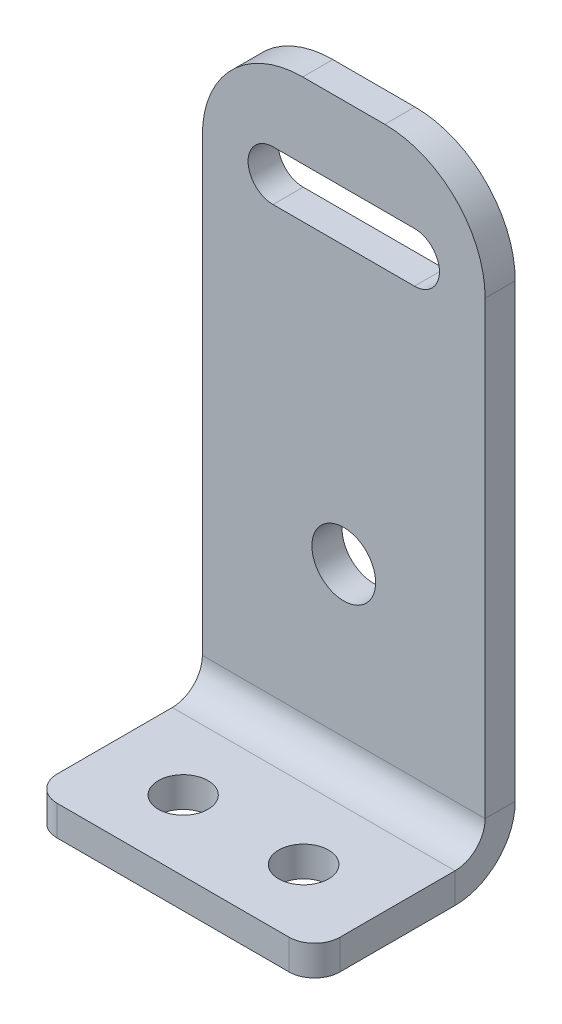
ISO-10303-21;
HEADER;
FILE_DESCRIPTION(('STEP AP214'),'2;1');
FILE_NAME('part.step','',(''),(''),'','','');
FILE_SCHEMA(('AUTOMOTIVE_DESIGN { 1 0 10303 214 1 1 1 1 }'));
ENDSEC;
DATA;
#1=APPLICATION_CONTEXT('core data for automotive mechanical design processes');
#2=APPLICATION_PROTOCOL_DEFINITION('international standard','automotive_design',2000,#1);
#3=PRODUCT_CONTEXT('',#1,'mechanical');
#4=PRODUCT('Part','Part','',(#3));
#5=PRODUCT_RELATED_PRODUCT_CATEGORY('part','',(#4));
#6=PRODUCT_DEFINITION_FORMATION('','',#4);
#7=PRODUCT_DEFINITION_CONTEXT('part definition',#1,'design');
#8=PRODUCT_DEFINITION('design','',#6,#7);
#9=PRODUCT_DEFINITION_SHAPE('','',#8);
#10=(LENGTH_UNIT() NAMED_UNIT(*) SI_UNIT(.MILLI.,.METRE.));
#11=(NAMED_UNIT(*) PLANE_ANGLE_UNIT() SI_UNIT($,.RADIAN.));
#12=(NAMED_UNIT(*) SI_UNIT($,.STERADIAN.) SOLID_ANGLE_UNIT());
#13=UNCERTAINTY_MEASURE_WITH_UNIT(LENGTH_MEASURE(1.E-05),#10,'distance_accuracy_value','');
#14=(GEOMETRIC_REPRESENTATION_CONTEXT(3) GLOBAL_UNCERTAINTY_ASSIGNED_CONTEXT((#13)) GLOBAL_UNIT_ASSIGNED_CONTEXT((#10,
#11,#12)) REPRESENTATION_CONTEXT('',''));
#15=CARTESIAN_POINT('',(0.,0.,0.));
#16=DIRECTION('',(0.,0.,1.));
#17=DIRECTION('',(1.,0.,0.));
#18=AXIS2_PLACEMENT_3D('',#15,#16,#17);
#19=CARTESIAN_POINT('',(28.175,0.,3.));
#20=DIRECTION('',(1.,0.,0.));
#21=DIRECTION('',(0.,1.,0.));
#22=AXIS2_PLACEMENT_3D('',#19,#20,#21);
#23=PLANE('',#22);
#24=DIRECTION('',(0.,1.,0.));
#25=VECTOR('',#24,1.);
#26=CARTESIAN_POINT('',(28.175,0.,-9.60000000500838E-08));
#27=LINE('',#26,#25);
#28=CARTESIAN_POINT('',(28.175,6.00000009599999,-9.59999996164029E-08));
#29=VERTEX_POINT('',#28);
#30=CARTESIAN_POINT('',(28.175,50.9125,-9.60000000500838E-08));
#31=VERTEX_POINT('',#30);
#32=EDGE_CURVE('E307',#29,#31,#27,.T.);
#33=ORIENTED_EDGE('',*,*,#32,.T.);
#34=DIRECTION('',(0.,0.,-1.));
#35=VECTOR('',#34,1.);
#36=CARTESIAN_POINT('',(28.175,50.9125,3.));
#37=LINE('',#36,#35);
#38=CARTESIAN_POINT('',(28.175,50.9125,3.));
#39=VERTEX_POINT('',#38);
#40=EDGE_CURVE('E13',#31,#39,#37,.F.);
#41=ORIENTED_EDGE('',*,*,#40,.T.);
#42=DIRECTION('',(0.,1.,0.));
#43=VECTOR('',#42,1.);
#44=CARTESIAN_POINT('',(28.175,0.,3.));
#45=LINE('',#44,#43);
#46=CARTESIAN_POINT('',(28.175,6.00000009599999,3.));
#47=VERTEX_POINT('',#46);
#48=EDGE_CURVE('E275',#47,#39,#45,.T.);
#49=ORIENTED_EDGE('',*,*,#48,.F.);
#50=DIRECTION('',(0.,0.,-1.));
#51=VECTOR('',#50,1.);
#52=CARTESIAN_POINT('',(28.175,6.00000009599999,3.));
#53=LINE('',#52,#51);
#54=EDGE_CURVE('E253',#47,#29,#53,.T.);
#55=ORIENTED_EDGE('',*,*,#54,.T.);
#56=EDGE_LOOP('',(#33,#41,#49,#55));
#57=FACE_BOUND('',#56,.T.);
#58=ADVANCED_FACE('F66',(#57),#23,.T.);
#59=CARTESIAN_POINT('',(0.,0.,3.));
#60=DIRECTION('',(0.,0.,1.));
#61=DIRECTION('',(1.,0.,0.));
#62=AXIS2_PLACEMENT_3D('',#59,#60,#61);
#63=PLANE('',#62);
#64=CARTESIAN_POINT('',(14.0875,20.9125,3.));
#65=DIRECTION('',(0.,0.,1.));
#66=DIRECTION('',(1.,0.,0.));
#67=AXIS2_PLACEMENT_3D('',#64,#65,#66);
#68=CIRCLE('',#67,3.175);
#69=CARTESIAN_POINT('',(17.2625,20.9125,3.));
#70=VERTEX_POINT('',#69);
#71=EDGE_CURVE('E271',#70,#70,#68,.T.);
#72=ORIENTED_EDGE('',*,*,#71,.F.);
#73=EDGE_LOOP('',(#72));
#74=FACE_BOUND('',#73,.T.);
#75=CARTESIAN_POINT('',(21.13125,50.9125,3.));
#76=DIRECTION('',(0.,0.,1.));
#77=DIRECTION('',(1.,0.,0.));
#78=AXIS2_PLACEMENT_3D('',#75,#76,#77);
#79=CIRCLE('',#78,2.4892);
#80=CARTESIAN_POINT('',(21.13125,48.4233,3.));
#81=VERTEX_POINT('',#80);
#82=CARTESIAN_POINT('',(21.13125,53.4017,3.));
#83=VERTEX_POINT('',#82);
#84=EDGE_CURVE('E287',#81,#83,#79,.T.);
#85=ORIENTED_EDGE('',*,*,#84,.F.);
#86=DIRECTION('',(1.,0.,0.));
#87=VECTOR('',#86,1.);
#88=CARTESIAN_POINT('',(0.,48.4233,3.));
#89=LINE('',#88,#87);
#90=CARTESIAN_POINT('',(7.04375,48.4233,3.));
#91=VERTEX_POINT('',#90);
#92=EDGE_CURVE('E291',#91,#81,#89,.T.);
#93=ORIENTED_EDGE('',*,*,#92,.F.);
#94=CARTESIAN_POINT('',(7.04375,50.9125,3.));
#95=DIRECTION('',(0.,0.,1.));
#96=DIRECTION('',(1.,0.,0.));
#97=AXIS2_PLACEMENT_3D('',#94,#95,#96);
#98=CIRCLE('',#97,2.4892);
#99=CARTESIAN_POINT('',(7.04375,53.4017,3.));
#100=VERTEX_POINT('',#99);
#101=EDGE_CURVE('E295',#100,#91,#98,.T.);
#102=ORIENTED_EDGE('',*,*,#101,.F.);
#103=DIRECTION('',(1.,0.,0.));
#104=VECTOR('',#103,1.);
#105=CARTESIAN_POINT('',(0.,53.4017,3.));
#106=LINE('',#105,#104);
#107=EDGE_CURVE('E299',#100,#83,#106,.T.);
#108=ORIENTED_EDGE('',*,*,#107,.T.);
#109=EDGE_LOOP('',(#85,#93,#102,#108));
#110=FACE_BOUND('',#109,.T.);
#111=DIRECTION('',(1.,0.,0.));
#112=VECTOR('',#111,1.);
#113=CARTESIAN_POINT('',(0.,60.9125,3.));
#114=LINE('',#113,#112);
#115=CARTESIAN_POINT('',(10.,60.9125,3.));
#116=VERTEX_POINT('',#115);
#117=CARTESIAN_POINT('',(18.175,60.9125,3.));
#118=VERTEX_POINT('',#117);
#119=EDGE_CURVE('E280',#116,#118,#114,.T.);
#120=ORIENTED_EDGE('',*,*,#119,.F.);
#121=CARTESIAN_POINT('',(10.,50.9125,3.));
#122=DIRECTION('',(0.,0.,1.));
#123=DIRECTION('',(1.,0.,0.));
#124=AXIS2_PLACEMENT_3D('',#121,#122,#123);
#125=CIRCLE('',#124,10.);
#126=CARTESIAN_POINT('',(0.,50.9125,3.));
#127=VERTEX_POINT('',#126);
#128=EDGE_CURVE('E377',#116,#127,#125,.T.);
#129=ORIENTED_EDGE('',*,*,#128,.T.);
#130=DIRECTION('',(0.,1.,0.));
#131=VECTOR('',#130,1.);
#132=CARTESIAN_POINT('',(0.,0.,3.));
#133=LINE('',#132,#131);
#134=CARTESIAN_POINT('',(0.,6.00000009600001,3.));
#135=VERTEX_POINT('',#134);
#136=EDGE_CURVE('E284',#135,#127,#133,.T.);
#137=ORIENTED_EDGE('',*,*,#136,.F.);
#138=DIRECTION('',(1.,0.,0.));
#139=VECTOR('',#138,1.);
#140=CARTESIAN_POINT('',(28.175,6.00000009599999,3.));
#141=LINE('',#140,#139);
#142=EDGE_CURVE('E258',#47,#135,#141,.F.);
#143=ORIENTED_EDGE('',*,*,#142,.F.);
#144=ORIENTED_EDGE('',*,*,#48,.T.);
#145=CARTESIAN_POINT('',(18.175,50.9125,3.));
#146=DIRECTION('',(0.,0.,1.));
#147=DIRECTION('',(1.,0.,0.));
#148=AXIS2_PLACEMENT_3D('',#145,#146,#147);
#149=CIRCLE('',#148,10.);
#150=EDGE_CURVE('E374',#39,#118,#149,.T.);
#151=ORIENTED_EDGE('',*,*,#150,.T.);
#152=EDGE_LOOP('',(#120,#129,#137,#143,#144,#151));
#153=FACE_BOUND('',#152,.T.);
#154=ADVANCED_FACE('F397',(#74,#110,#153),#63,.T.);
#155=CARTESIAN_POINT('',(0.,0.,-9.60000000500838E-08));
#156=DIRECTION('',(0.,0.,1.));
#157=DIRECTION('',(1.,0.,0.));
#158=AXIS2_PLACEMENT_3D('',#155,#156,#157);
#159=PLANE('',#158);
#160=CARTESIAN_POINT('',(21.13125,50.9125,-9.60000000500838E-08));
#161=DIRECTION('',(0.,0.,1.));
#162=DIRECTION('',(1.,0.,0.));
#163=AXIS2_PLACEMENT_3D('',#160,#161,#162);
#164=CIRCLE('',#163,2.4892);
#165=CARTESIAN_POINT('',(21.13125,48.4233,-9.60000000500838E-08));
#166=VERTEX_POINT('',#165);
#167=CARTESIAN_POINT('',(21.13125,53.4017,-9.60000000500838E-08));
#168=VERTEX_POINT('',#167);
#169=EDGE_CURVE('E314',#166,#168,#164,.T.);
#170=ORIENTED_EDGE('',*,*,#169,.T.);
#171=DIRECTION('',(1.,0.,0.));
#172=VECTOR('',#171,1.);
#173=CARTESIAN_POINT('',(0.,53.4017,-9.60000000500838E-08));
#174=LINE('',#173,#172);
#175=CARTESIAN_POINT('',(7.04375,53.4017,-9.60000000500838E-08));
#176=VERTEX_POINT('',#175);
#177=EDGE_CURVE('E276',#176,#168,#174,.T.);
#178=ORIENTED_EDGE('',*,*,#177,.F.);
#179=CARTESIAN_POINT('',(7.04375,50.9125,-9.60000000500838E-08));
#180=DIRECTION('',(0.,0.,1.));
#181=DIRECTION('',(1.,0.,0.));
#182=AXIS2_PLACEMENT_3D('',#179,#180,#181);
#183=CIRCLE('',#182,2.4892);
#184=CARTESIAN_POINT('',(7.04375,48.4233,-9.60000000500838E-08));
#185=VERTEX_POINT('',#184);
#186=EDGE_CURVE('E324',#176,#185,#183,.T.);
#187=ORIENTED_EDGE('',*,*,#186,.T.);
#188=DIRECTION('',(1.,0.,0.));
#189=VECTOR('',#188,1.);
#190=CARTESIAN_POINT('',(0.,48.4233,-9.60000000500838E-08));
#191=LINE('',#190,#189);
#192=EDGE_CURVE('E320',#185,#166,#191,.T.);
#193=ORIENTED_EDGE('',*,*,#192,.T.);
#194=EDGE_LOOP('',(#170,#178,#187,#193));
#195=FACE_BOUND('',#194,.T.);
#196=CARTESIAN_POINT('',(14.0875,20.9125,-9.60000000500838E-08));
#197=DIRECTION('',(0.,0.,1.));
#198=DIRECTION('',(1.,0.,0.));
#199=AXIS2_PLACEMENT_3D('',#196,#197,#198);
#200=CIRCLE('',#199,3.175);
#201=CARTESIAN_POINT('',(17.2625,20.9125,-9.60000000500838E-08));
#202=VERTEX_POINT('',#201);
#203=EDGE_CURVE('E268',#202,#202,#200,.T.);
#204=ORIENTED_EDGE('',*,*,#203,.T.);
#205=EDGE_LOOP('',(#204));
#206=FACE_BOUND('',#205,.T.);
#207=DIRECTION('',(0.,1.,0.));
#208=VECTOR('',#207,1.);
#209=CARTESIAN_POINT('',(0.,0.,-9.60000000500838E-08));
#210=LINE('',#209,#208);
#211=CARTESIAN_POINT('',(0.,6.00000009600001,-9.60000000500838E-08));
#212=VERTEX_POINT('',#211);
#213=CARTESIAN_POINT('',(0.,50.9125,-9.60000000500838E-08));
#214=VERTEX_POINT('',#213);
#215=EDGE_CURVE('E311',#212,#214,#210,.T.);
#216=ORIENTED_EDGE('',*,*,#215,.T.);
#217=CARTESIAN_POINT('',(10.,50.9125,-9.60000000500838E-08));
#218=DIRECTION('',(0.,0.,1.));
#219=DIRECTION('',(1.,0.,0.));
#220=AXIS2_PLACEMENT_3D('',#217,#218,#219);
#221=CIRCLE('',#220,10.);
#222=CARTESIAN_POINT('',(10.,60.9125,-9.60000000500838E-08));
#223=VERTEX_POINT('',#222);
#224=EDGE_CURVE('E75',#214,#223,#221,.F.);
#225=ORIENTED_EDGE('',*,*,#224,.T.);
#226=DIRECTION('',(1.,0.,0.));
#227=VECTOR('',#226,1.);
#228=CARTESIAN_POINT('',(0.,60.9125,-9.60000000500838E-08));
#229=LINE('',#228,#227);
#230=CARTESIAN_POINT('',(18.175,60.9125,-9.60000000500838E-08));
#231=VERTEX_POINT('',#230);
#232=EDGE_CURVE('E310',#223,#231,#229,.T.);
#233=ORIENTED_EDGE('',*,*,#232,.T.);
#234=CARTESIAN_POINT('',(18.175,50.9125,-9.60000000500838E-08));
#235=DIRECTION('',(0.,0.,1.));
#236=DIRECTION('',(1.,0.,0.));
#237=AXIS2_PLACEMENT_3D('',#234,#235,#236);
#238=CIRCLE('',#237,10.);
#239=EDGE_CURVE('E82',#231,#31,#238,.F.);
#240=ORIENTED_EDGE('',*,*,#239,.T.);
#241=ORIENTED_EDGE('',*,*,#32,.F.);
#242=DIRECTION('',(1.,0.,0.));
#243=VECTOR('',#242,1.);
#244=CARTESIAN_POINT('',(28.175,6.00000009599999,-9.59999996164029E-08));
#245=LINE('',#244,#243);
#246=EDGE_CURVE('E192',#29,#212,#245,.F.);
#247=ORIENTED_EDGE('',*,*,#246,.T.);
#248=EDGE_LOOP('',(#216,#225,#233,#240,#241,#247));
#249=FACE_BOUND('',#248,.T.);
#250=ADVANCED_FACE('F387',(#195,#206,#249),#159,.F.);
#251=CARTESIAN_POINT('',(7.04375,50.9125,3.));
#252=DIRECTION('',(0.,0.,1.));
#253=DIRECTION('',(1.,0.,0.));
#254=AXIS2_PLACEMENT_3D('',#251,#252,#253);
#255=CYLINDRICAL_SURFACE('',#254,2.4892);
#256=DIRECTION('',(0.,0.,1.));
#257=VECTOR('',#256,1.);
#258=CARTESIAN_POINT('',(7.04375,48.4233,3.));
#259=LINE('',#258,#257);
#260=EDGE_CURVE('E337',#185,#91,#259,.T.);
#261=ORIENTED_EDGE('',*,*,#260,.F.);
#262=ORIENTED_EDGE('',*,*,#186,.F.);
#263=DIRECTION('',(0.,0.,1.));
#264=VECTOR('',#263,1.);
#265=CARTESIAN_POINT('',(7.04375,53.4017,3.));
#266=LINE('',#265,#264);
#267=EDGE_CURVE('E334',#176,#100,#266,.T.);
#268=ORIENTED_EDGE('',*,*,#267,.T.);
#269=ORIENTED_EDGE('',*,*,#101,.T.);
#270=EDGE_LOOP('',(#261,#262,#268,#269));
#271=FACE_BOUND('',#270,.T.);
#272=ADVANCED_FACE('F492',(#271),#255,.F.);
#273=CARTESIAN_POINT('',(0.,53.4017,3.));
#274=DIRECTION('',(0.,-1.,0.));
#275=DIRECTION('',(1.,0.,0.));
#276=AXIS2_PLACEMENT_3D('',#273,#274,#275);
#277=PLANE('',#276);
#278=ORIENTED_EDGE('',*,*,#267,.F.);
#279=ORIENTED_EDGE('',*,*,#177,.T.);
#280=DIRECTION('',(0.,0.,1.));
#281=VECTOR('',#280,1.);
#282=CARTESIAN_POINT('',(21.13125,53.4017,3.));
#283=LINE('',#282,#281);
#284=EDGE_CURVE('E331',#168,#83,#283,.T.);
#285=ORIENTED_EDGE('',*,*,#284,.T.);
#286=ORIENTED_EDGE('',*,*,#107,.F.);
#287=EDGE_LOOP('',(#278,#279,#285,#286));
#288=FACE_BOUND('',#287,.T.);
#289=ADVANCED_FACE('F488',(#288),#277,.T.);
#290=CARTESIAN_POINT('',(21.13125,50.9125,3.));
#291=DIRECTION('',(0.,0.,1.));
#292=DIRECTION('',(1.,0.,0.));
#293=AXIS2_PLACEMENT_3D('',#290,#291,#292);
#294=CYLINDRICAL_SURFACE('',#293,2.4892);
#295=ORIENTED_EDGE('',*,*,#284,.F.);
#296=ORIENTED_EDGE('',*,*,#169,.F.);
#297=DIRECTION('',(0.,0.,1.));
#298=VECTOR('',#297,1.);
#299=CARTESIAN_POINT('',(21.13125,48.4233,3.));
#300=LINE('',#299,#298);
#301=EDGE_CURVE('E303',#166,#81,#300,.T.);
#302=ORIENTED_EDGE('',*,*,#301,.T.);
#303=ORIENTED_EDGE('',*,*,#84,.T.);
#304=EDGE_LOOP('',(#295,#296,#302,#303));
#305=FACE_BOUND('',#304,.T.);
#306=ADVANCED_FACE('F482',(#305),#294,.F.);
#307=CARTESIAN_POINT('',(0.,0.,3.));
#308=DIRECTION('',(1.,0.,0.));
#309=DIRECTION('',(0.,1.,0.));
#310=AXIS2_PLACEMENT_3D('',#307,#308,#309);
#311=PLANE('',#310);
#312=ORIENTED_EDGE('',*,*,#136,.T.);
#313=DIRECTION('',(0.,0.,-1.));
#314=VECTOR('',#313,1.);
#315=CARTESIAN_POINT('',(0.,50.9125,3.));
#316=LINE('',#315,#314);
#317=EDGE_CURVE('E90',#127,#214,#316,.T.);
#318=ORIENTED_EDGE('',*,*,#317,.T.);
#319=ORIENTED_EDGE('',*,*,#215,.F.);
#320=DIRECTION('',(0.,0.,-1.));
#321=VECTOR('',#320,1.);
#322=CARTESIAN_POINT('',(0.,6.00000009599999,3.));
#323=LINE('',#322,#321);
#324=EDGE_CURVE('E264',#135,#212,#323,.T.);
#325=ORIENTED_EDGE('',*,*,#324,.F.);
#326=EDGE_LOOP('',(#312,#318,#319,#325));
#327=FACE_BOUND('',#326,.T.);
#328=ADVANCED_FACE('F398',(#327),#311,.F.);
#329=CARTESIAN_POINT('',(14.0875,20.9125,3.));
#330=DIRECTION('',(0.,0.,1.));
#331=DIRECTION('',(1.,0.,0.));
#332=AXIS2_PLACEMENT_3D('',#329,#330,#331);
#333=CYLINDRICAL_SURFACE('',#332,3.175);
#334=ORIENTED_EDGE('',*,*,#71,.T.);
#335=EDGE_LOOP('',(#334));
#336=FACE_BOUND('',#335,.T.);
#337=ORIENTED_EDGE('',*,*,#203,.F.);
#338=EDGE_LOOP('',(#337));
#339=FACE_BOUND('',#338,.T.);
#340=ADVANCED_FACE('F478',(#336,#339),#333,.F.);
#341=CARTESIAN_POINT('',(0.,60.9125,3.));
#342=DIRECTION('',(0.,-1.,0.));
#343=DIRECTION('',(1.,0.,0.));
#344=AXIS2_PLACEMENT_3D('',#341,#342,#343);
#345=PLANE('',#344);
#346=ORIENTED_EDGE('',*,*,#232,.F.);
#347=DIRECTION('',(0.,0.,-1.));
#348=VECTOR('',#347,1.);
#349=CARTESIAN_POINT('',(10.,60.9125,3.));
#350=LINE('',#349,#348);
#351=EDGE_CURVE('E370',#223,#116,#350,.F.);
#352=ORIENTED_EDGE('',*,*,#351,.T.);
#353=ORIENTED_EDGE('',*,*,#119,.T.);
#354=DIRECTION('',(0.,0.,1.));
#355=VECTOR('',#354,1.);
#356=CARTESIAN_POINT('',(18.175,60.9125,3.));
#357=LINE('',#356,#355);
#358=EDGE_CURVE('E367',#118,#231,#357,.F.);
#359=ORIENTED_EDGE('',*,*,#358,.T.);
#360=EDGE_LOOP('',(#346,#352,#353,#359));
#361=FACE_BOUND('',#360,.T.);
#362=ADVANCED_FACE('F391',(#361),#345,.F.);
#363=CARTESIAN_POINT('',(0.,48.4233,3.));
#364=DIRECTION('',(0.,-1.,0.));
#365=DIRECTION('',(1.,0.,0.));
#366=AXIS2_PLACEMENT_3D('',#363,#364,#365);
#367=PLANE('',#366);
#368=ORIENTED_EDGE('',*,*,#192,.F.);
#369=ORIENTED_EDGE('',*,*,#260,.T.);
#370=ORIENTED_EDGE('',*,*,#92,.T.);
#371=ORIENTED_EDGE('',*,*,#301,.F.);
#372=EDGE_LOOP('',(#368,#369,#370,#371));
#373=FACE_BOUND('',#372,.T.);
#374=ADVANCED_FACE('F485',(#373),#367,.F.);
#375=CARTESIAN_POINT('',(0.,6.00000009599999,6.));
#376=DIRECTION('',(-1.,0.,0.));
#377=DIRECTION('',(0.,0.,1.));
#378=AXIS2_PLACEMENT_3D('',#375,#376,#377);
#379=PLANE('',#378);
#380=DIRECTION('',(0.,1.,0.));
#381=VECTOR('',#380,1.);
#382=CARTESIAN_POINT('',(0.,0.,5.99999999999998));
#383=LINE('',#382,#381);
#384=CARTESIAN_POINT('',(0.,3.00000009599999,5.99999999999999));
#385=VERTEX_POINT('',#384);
#386=CARTESIAN_POINT('',(0.,0.,5.99999999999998));
#387=VERTEX_POINT('',#386);
#388=EDGE_CURVE('E244',#385,#387,#383,.F.);
#389=ORIENTED_EDGE('',*,*,#388,.F.);
#390=CARTESIAN_POINT('',(0.,6.00000009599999,6.));
#391=DIRECTION('',(1.,0.,0.));
#392=DIRECTION('',(0.,0.,-1.));
#393=AXIS2_PLACEMENT_3D('',#390,#391,#392);
#394=CIRCLE('',#393,3.);
#395=EDGE_CURVE('E196',#135,#385,#394,.F.);
#396=ORIENTED_EDGE('',*,*,#395,.F.);
#397=ORIENTED_EDGE('',*,*,#324,.T.);
#398=CARTESIAN_POINT('',(0.,6.00000009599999,6.));
#399=DIRECTION('',(1.,0.,0.));
#400=DIRECTION('',(0.,0.,-1.));
#401=AXIS2_PLACEMENT_3D('',#398,#399,#400);
#402=CIRCLE('',#401,6.000000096);
#403=EDGE_CURVE('E251',#212,#387,#402,.F.);
#404=ORIENTED_EDGE('',*,*,#403,.T.);
#405=EDGE_LOOP('',(#389,#396,#397,#404));
#406=FACE_BOUND('',#405,.T.);
#407=ADVANCED_FACE('F402',(#406),#379,.T.);
#408=CARTESIAN_POINT('',(28.175,6.00000009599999,6.));
#409=DIRECTION('',(-1.,0.,0.));
#410=DIRECTION('',(0.,0.,1.));
#411=AXIS2_PLACEMENT_3D('',#408,#409,#410);
#412=PLANE('',#411);
#413=CARTESIAN_POINT('',(28.175,6.00000009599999,6.));
#414=DIRECTION('',(1.,0.,0.));
#415=DIRECTION('',(0.,0.,-1.));
#416=AXIS2_PLACEMENT_3D('',#413,#414,#415);
#417=CIRCLE('',#416,3.);
#418=CARTESIAN_POINT('',(28.175,3.00000009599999,5.99999999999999));
#419=VERTEX_POINT('',#418);
#420=EDGE_CURVE('E203',#419,#47,#417,.T.);
#421=ORIENTED_EDGE('',*,*,#420,.F.);
#422=DIRECTION('',(0.,1.,0.));
#423=VECTOR('',#422,1.);
#424=CARTESIAN_POINT('',(28.175,3.00000009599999,5.99999999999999));
#425=LINE('',#424,#423);
#426=CARTESIAN_POINT('',(28.175,0.,5.99999999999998));
#427=VERTEX_POINT('',#426);
#428=EDGE_CURVE('E200',#419,#427,#425,.F.);
#429=ORIENTED_EDGE('',*,*,#428,.T.);
#430=CARTESIAN_POINT('',(28.175,6.00000009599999,6.));
#431=DIRECTION('',(1.,0.,0.));
#432=DIRECTION('',(0.,0.,-1.));
#433=AXIS2_PLACEMENT_3D('',#430,#431,#432);
#434=CIRCLE('',#433,6.000000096);
#435=EDGE_CURVE('E185',#427,#29,#434,.T.);
#436=ORIENTED_EDGE('',*,*,#435,.T.);
#437=ORIENTED_EDGE('',*,*,#54,.F.);
#438=EDGE_LOOP('',(#421,#429,#436,#437));
#439=FACE_BOUND('',#438,.T.);
#440=ADVANCED_FACE('F201',(#439),#412,.F.);
#441=CARTESIAN_POINT('',(28.175,6.00000009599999,6.));
#442=DIRECTION('',(1.,0.,0.));
#443=DIRECTION('',(0.,-1.,0.));
#444=AXIS2_PLACEMENT_3D('',#441,#442,#443);
#445=CYLINDRICAL_SURFACE('',#444,6.000000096);
#446=ORIENTED_EDGE('',*,*,#246,.F.);
#447=ORIENTED_EDGE('',*,*,#435,.F.);
#448=DIRECTION('',(1.,0.,0.));
#449=VECTOR('',#448,1.);
#450=CARTESIAN_POINT('',(0.,0.,5.99999999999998));
#451=LINE('',#450,#449);
#452=EDGE_CURVE('E190',#427,#387,#451,.F.);
#453=ORIENTED_EDGE('',*,*,#452,.T.);
#454=ORIENTED_EDGE('',*,*,#403,.F.);
#455=EDGE_LOOP('',(#446,#447,#453,#454));
#456=FACE_BOUND('',#455,.T.);
#457=ADVANCED_FACE('F187',(#456),#445,.T.);
#458=CARTESIAN_POINT('',(28.175,6.00000009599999,6.));
#459=DIRECTION('',(1.,0.,0.));
#460=DIRECTION('',(0.,-1.,0.));
#461=AXIS2_PLACEMENT_3D('',#458,#459,#460);
#462=CYLINDRICAL_SURFACE('',#461,3.);
#463=ORIENTED_EDGE('',*,*,#142,.T.);
#464=ORIENTED_EDGE('',*,*,#395,.T.);
#465=DIRECTION('',(1.,0.,0.));
#466=VECTOR('',#465,1.);
#467=CARTESIAN_POINT('',(0.,3.00000009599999,5.99999999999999));
#468=LINE('',#467,#466);
#469=EDGE_CURVE('E209',#385,#419,#468,.T.);
#470=ORIENTED_EDGE('',*,*,#469,.T.);
#471=ORIENTED_EDGE('',*,*,#420,.T.);
#472=EDGE_LOOP('',(#463,#464,#470,#471));
#473=FACE_BOUND('',#472,.T.);
#474=ADVANCED_FACE('F405',(#473),#462,.F.);
#475=CARTESIAN_POINT('',(28.175,0.,19.999999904));
#476=DIRECTION('',(-1.,0.,0.));
#477=DIRECTION('',(0.,0.,1.));
#478=AXIS2_PLACEMENT_3D('',#475,#476,#477);
#479=PLANE('',#478);
#480=DIRECTION('',(0.,0.,-1.));
#481=VECTOR('',#480,1.);
#482=CARTESIAN_POINT('',(28.175,3.00000009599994,19.999999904));
#483=LINE('',#482,#481);
#484=CARTESIAN_POINT('',(28.175,3.00000009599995,17.459999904));
#485=VERTEX_POINT('',#484);
#486=EDGE_CURVE('E220',#419,#485,#483,.F.);
#487=ORIENTED_EDGE('',*,*,#486,.T.);
#488=DIRECTION('',(0.,1.,0.));
#489=VECTOR('',#488,1.);
#490=CARTESIAN_POINT('',(28.175,0.,17.459999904));
#491=LINE('',#490,#489);
#492=CARTESIAN_POINT('',(28.175,0.,17.459999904));
#493=VERTEX_POINT('',#492);
#494=EDGE_CURVE('E224',#485,#493,#491,.F.);
#495=ORIENTED_EDGE('',*,*,#494,.T.);
#496=DIRECTION('',(0.,0.,1.));
#497=VECTOR('',#496,1.);
#498=CARTESIAN_POINT('',(28.175,0.,0.));
#499=LINE('',#498,#497);
#500=EDGE_CURVE('E215',#427,#493,#499,.T.);
#501=ORIENTED_EDGE('',*,*,#500,.F.);
#502=ORIENTED_EDGE('',*,*,#428,.F.);
#503=EDGE_LOOP('',(#487,#495,#501,#502));
#504=FACE_BOUND('',#503,.T.);
#505=ADVANCED_FACE('F222',(#504),#479,.F.);
#506=CARTESIAN_POINT('',(0.,0.,2.99999999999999));
#507=DIRECTION('',(1.,0.,0.));
#508=DIRECTION('',(0.,0.,-1.));
#509=AXIS2_PLACEMENT_3D('',#506,#507,#508);
#510=PLANE('',#509);
#511=DIRECTION('',(0.,0.,-1.));
#512=VECTOR('',#511,1.);
#513=CARTESIAN_POINT('',(0.,0.,0.));
#514=LINE('',#513,#512);
#515=CARTESIAN_POINT('',(0.,0.,17.459999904));
#516=VERTEX_POINT('',#515);
#517=EDGE_CURVE('E218',#516,#387,#514,.T.);
#518=ORIENTED_EDGE('',*,*,#517,.F.);
#519=DIRECTION('',(0.,1.,0.));
#520=VECTOR('',#519,1.);
#521=CARTESIAN_POINT('',(0.,0.,17.459999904));
#522=LINE('',#521,#520);
#523=CARTESIAN_POINT('',(0.,3.00000009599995,17.459999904));
#524=VERTEX_POINT('',#523);
#525=EDGE_CURVE('E340',#516,#524,#522,.T.);
#526=ORIENTED_EDGE('',*,*,#525,.T.);
#527=DIRECTION('',(0.,0.,1.));
#528=VECTOR('',#527,1.);
#529=CARTESIAN_POINT('',(0.,3.000000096,3.));
#530=LINE('',#529,#528);
#531=EDGE_CURVE('E227',#524,#385,#530,.F.);
#532=ORIENTED_EDGE('',*,*,#531,.T.);
#533=ORIENTED_EDGE('',*,*,#388,.T.);
#534=EDGE_LOOP('',(#518,#526,#532,#533));
#535=FACE_BOUND('',#534,.T.);
#536=ADVANCED_FACE('F422',(#535),#510,.F.);
#537=CARTESIAN_POINT('',(0.,0.,0.));
#538=DIRECTION('',(0.,1.,0.));
#539=DIRECTION('',(0.,0.,1.));
#540=AXIS2_PLACEMENT_3D('',#537,#538,#539);
#541=PLANE('',#540);
#542=CARTESIAN_POINT('',(8.0875,-1.01915004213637E-13,12.999999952));
#543=DIRECTION('',(0.,1.,0.));
#544=DIRECTION('',(0.,0.,1.));
#545=AXIS2_PLACEMENT_3D('',#542,#543,#544);
#546=CIRCLE('',#545,2.4765);
#547=CARTESIAN_POINT('',(8.0875,-1.09987718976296E-13,15.476499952));
#548=VERTEX_POINT('',#547);
#549=EDGE_CURVE('E248',#548,#548,#546,.T.);
#550=ORIENTED_EDGE('',*,*,#549,.T.);
#551=EDGE_LOOP('',(#550));
#552=FACE_BOUND('',#551,.T.);
#553=CARTESIAN_POINT('',(20.0875,-1.01915004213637E-13,12.999999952));
#554=DIRECTION('',(0.,1.,0.));
#555=DIRECTION('',(0.,0.,1.));
#556=AXIS2_PLACEMENT_3D('',#553,#554,#555);
#557=CIRCLE('',#556,2.4892);
#558=CARTESIAN_POINT('',(20.0875,-1.10029117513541E-13,15.489199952));
#559=VERTEX_POINT('',#558);
#560=EDGE_CURVE('E430',#559,#559,#557,.T.);
#561=ORIENTED_EDGE('',*,*,#560,.T.);
#562=EDGE_LOOP('',(#561));
#563=FACE_BOUND('',#562,.T.);
#564=DIRECTION('',(-1.,0.,0.));
#565=VECTOR('',#564,1.);
#566=CARTESIAN_POINT('',(0.,0.,19.999999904));
#567=LINE('',#566,#565);
#568=CARTESIAN_POINT('',(25.635,0.,19.999999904));
#569=VERTEX_POINT('',#568);
#570=CARTESIAN_POINT('',(2.54,0.,19.999999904));
#571=VERTEX_POINT('',#570);
#572=EDGE_CURVE('E226',#569,#571,#567,.T.);
#573=ORIENTED_EDGE('',*,*,#572,.T.);
#574=CARTESIAN_POINT('',(2.54,0.,17.459999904));
#575=DIRECTION('',(0.,1.,0.));
#576=DIRECTION('',(0.,0.,1.));
#577=AXIS2_PLACEMENT_3D('',#574,#575,#576);
#578=CIRCLE('',#577,2.54);
#579=EDGE_CURVE('E362',#571,#516,#578,.F.);
#580=ORIENTED_EDGE('',*,*,#579,.T.);
#581=ORIENTED_EDGE('',*,*,#517,.T.);
#582=ORIENTED_EDGE('',*,*,#452,.F.);
#583=ORIENTED_EDGE('',*,*,#500,.T.);
#584=CARTESIAN_POINT('',(25.635,0.,17.459999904));
#585=DIRECTION('',(0.,1.,0.));
#586=DIRECTION('',(0.,0.,1.));
#587=AXIS2_PLACEMENT_3D('',#584,#585,#586);
#588=CIRCLE('',#587,2.54);
#589=EDGE_CURVE('E359',#493,#569,#588,.F.);
#590=ORIENTED_EDGE('',*,*,#589,.T.);
#591=EDGE_LOOP('',(#573,#580,#581,#582,#583,#590));
#592=FACE_BOUND('',#591,.T.);
#593=ADVANCED_FACE('F214',(#552,#563,#592),#541,.F.);
#594=CARTESIAN_POINT('',(0.,3.00000009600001,0.));
#595=DIRECTION('',(0.,1.,0.));
#596=DIRECTION('',(0.,0.,1.));
#597=AXIS2_PLACEMENT_3D('',#594,#595,#596);
#598=PLANE('',#597);
#599=CARTESIAN_POINT('',(8.0875,3.00000009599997,12.999999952));
#600=DIRECTION('',(0.,1.,0.));
#601=DIRECTION('',(0.,0.,1.));
#602=AXIS2_PLACEMENT_3D('',#599,#600,#601);
#603=CIRCLE('',#602,2.4765);
#604=CARTESIAN_POINT('',(8.0875,3.00000009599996,15.476499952));
#605=VERTEX_POINT('',#604);
#606=EDGE_CURVE('E434',#605,#605,#603,.T.);
#607=ORIENTED_EDGE('',*,*,#606,.F.);
#608=EDGE_LOOP('',(#607));
#609=FACE_BOUND('',#608,.T.);
#610=CARTESIAN_POINT('',(20.0875,3.00000009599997,12.999999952));
#611=DIRECTION('',(0.,1.,0.));
#612=DIRECTION('',(0.,0.,1.));
#613=AXIS2_PLACEMENT_3D('',#610,#611,#612);
#614=CIRCLE('',#613,2.4892);
#615=CARTESIAN_POINT('',(20.0875,3.00000009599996,15.489199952));
#616=VERTEX_POINT('',#615);
#617=EDGE_CURVE('E426',#616,#616,#614,.T.);
#618=ORIENTED_EDGE('',*,*,#617,.F.);
#619=EDGE_LOOP('',(#618));
#620=FACE_BOUND('',#619,.T.);
#621=ORIENTED_EDGE('',*,*,#531,.F.);
#622=CARTESIAN_POINT('',(2.54,3.00000009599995,17.459999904));
#623=DIRECTION('',(0.,1.,0.));
#624=DIRECTION('',(0.,0.,1.));
#625=AXIS2_PLACEMENT_3D('',#622,#623,#624);
#626=CIRCLE('',#625,2.54);
#627=CARTESIAN_POINT('',(2.54,3.00000009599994,19.999999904));
#628=VERTEX_POINT('',#627);
#629=EDGE_CURVE('E349',#524,#628,#626,.T.);
#630=ORIENTED_EDGE('',*,*,#629,.T.);
#631=DIRECTION('',(1.,0.,0.));
#632=VECTOR('',#631,1.);
#633=CARTESIAN_POINT('',(0.,3.00000009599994,19.999999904));
#634=LINE('',#633,#632);
#635=CARTESIAN_POINT('',(25.635,3.00000009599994,19.999999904));
#636=VERTEX_POINT('',#635);
#637=EDGE_CURVE('E233',#636,#628,#634,.F.);
#638=ORIENTED_EDGE('',*,*,#637,.F.);
#639=CARTESIAN_POINT('',(25.635,3.00000009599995,17.459999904));
#640=DIRECTION('',(0.,1.,0.));
#641=DIRECTION('',(0.,0.,1.));
#642=AXIS2_PLACEMENT_3D('',#639,#640,#641);
#643=CIRCLE('',#642,2.54);
#644=EDGE_CURVE('E346',#636,#485,#643,.T.);
#645=ORIENTED_EDGE('',*,*,#644,.T.);
#646=ORIENTED_EDGE('',*,*,#486,.F.);
#647=ORIENTED_EDGE('',*,*,#469,.F.);
#648=EDGE_LOOP('',(#621,#630,#638,#645,#646,#647));
#649=FACE_BOUND('',#648,.T.);
#650=ADVANCED_FACE('F408',(#609,#620,#649),#598,.T.);
#651=CARTESIAN_POINT('',(0.,0.,19.999999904));
#652=DIRECTION('',(0.,0.,-1.));
#653=DIRECTION('',(0.,1.,0.));
#654=AXIS2_PLACEMENT_3D('',#651,#652,#653);
#655=PLANE('',#654);
#656=ORIENTED_EDGE('',*,*,#637,.T.);
#657=DIRECTION('',(0.,1.,0.));
#658=VECTOR('',#657,1.);
#659=CARTESIAN_POINT('',(2.54,0.,19.999999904));
#660=LINE('',#659,#658);
#661=EDGE_CURVE('E356',#628,#571,#660,.F.);
#662=ORIENTED_EDGE('',*,*,#661,.T.);
#663=ORIENTED_EDGE('',*,*,#572,.F.);
#664=DIRECTION('',(0.,1.,0.));
#665=VECTOR('',#664,1.);
#666=CARTESIAN_POINT('',(25.635,0.,19.999999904));
#667=LINE('',#666,#665);
#668=EDGE_CURVE('E352',#569,#636,#667,.T.);
#669=ORIENTED_EDGE('',*,*,#668,.T.);
#670=EDGE_LOOP('',(#656,#662,#663,#669));
#671=FACE_BOUND('',#670,.T.);
#672=ADVANCED_FACE('F416',(#671),#655,.F.);
#673=CARTESIAN_POINT('',(20.0875,-1.01915004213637E-13,12.999999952));
#674=DIRECTION('',(0.,1.,0.));
#675=DIRECTION('',(0.,0.,1.));
#676=AXIS2_PLACEMENT_3D('',#673,#674,#675);
#677=CYLINDRICAL_SURFACE('',#676,2.4892);
#678=ORIENTED_EDGE('',*,*,#560,.F.);
#679=EDGE_LOOP('',(#678));
#680=FACE_BOUND('',#679,.T.);
#681=ORIENTED_EDGE('',*,*,#617,.T.);
#682=EDGE_LOOP('',(#681));
#683=FACE_BOUND('',#682,.T.);
#684=ADVANCED_FACE('F448',(#680,#683),#677,.F.);
#685=CARTESIAN_POINT('',(8.0875,-1.01915004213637E-13,12.999999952));
#686=DIRECTION('',(0.,1.,0.));
#687=DIRECTION('',(0.,0.,1.));
#688=AXIS2_PLACEMENT_3D('',#685,#686,#687);
#689=CYLINDRICAL_SURFACE('',#688,2.4765);
#690=ORIENTED_EDGE('',*,*,#549,.F.);
#691=EDGE_LOOP('',(#690));
#692=FACE_BOUND('',#691,.T.);
#693=ORIENTED_EDGE('',*,*,#606,.T.);
#694=EDGE_LOOP('',(#693));
#695=FACE_BOUND('',#694,.T.);
#696=ADVANCED_FACE('F445',(#692,#695),#689,.F.);
#697=CARTESIAN_POINT('',(2.54,0.,17.459999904));
#698=DIRECTION('',(0.,1.,0.));
#699=DIRECTION('',(0.,0.,1.));
#700=AXIS2_PLACEMENT_3D('',#697,#698,#699);
#701=CYLINDRICAL_SURFACE('',#700,2.54);
#702=ORIENTED_EDGE('',*,*,#579,.F.);
#703=ORIENTED_EDGE('',*,*,#661,.F.);
#704=ORIENTED_EDGE('',*,*,#629,.F.);
#705=ORIENTED_EDGE('',*,*,#525,.F.);
#706=EDGE_LOOP('',(#702,#703,#704,#705));
#707=FACE_BOUND('',#706,.T.);
#708=ADVANCED_FACE('F419',(#707),#701,.T.);
#709=CARTESIAN_POINT('',(25.635,0.,17.459999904));
#710=DIRECTION('',(0.,1.,0.));
#711=DIRECTION('',(0.,0.,1.));
#712=AXIS2_PLACEMENT_3D('',#709,#710,#711);
#713=CYLINDRICAL_SURFACE('',#712,2.54);
#714=ORIENTED_EDGE('',*,*,#589,.F.);
#715=ORIENTED_EDGE('',*,*,#494,.F.);
#716=ORIENTED_EDGE('',*,*,#644,.F.);
#717=ORIENTED_EDGE('',*,*,#668,.F.);
#718=EDGE_LOOP('',(#714,#715,#716,#717));
#719=FACE_BOUND('',#718,.T.);
#720=ADVANCED_FACE('F411',(#719),#713,.T.);
#721=CARTESIAN_POINT('',(10.,50.9125,3.));
#722=DIRECTION('',(0.,0.,1.));
#723=DIRECTION('',(1.,0.,0.));
#724=AXIS2_PLACEMENT_3D('',#721,#722,#723);
#725=CYLINDRICAL_SURFACE('',#724,10.);
#726=ORIENTED_EDGE('',*,*,#224,.F.);
#727=ORIENTED_EDGE('',*,*,#317,.F.);
#728=ORIENTED_EDGE('',*,*,#128,.F.);
#729=ORIENTED_EDGE('',*,*,#351,.F.);
#730=EDGE_LOOP('',(#726,#727,#728,#729));
#731=FACE_BOUND('',#730,.T.);
#732=ADVANCED_FACE('F394',(#731),#725,.T.);
#733=CARTESIAN_POINT('',(18.175,50.9125,3.));
#734=DIRECTION('',(0.,0.,-1.));
#735=DIRECTION('',(-1.,0.,0.));
#736=AXIS2_PLACEMENT_3D('',#733,#734,#735);
#737=CYLINDRICAL_SURFACE('',#736,10.);
#738=ORIENTED_EDGE('',*,*,#239,.F.);
#739=ORIENTED_EDGE('',*,*,#358,.F.);
#740=ORIENTED_EDGE('',*,*,#150,.F.);
#741=ORIENTED_EDGE('',*,*,#40,.F.);
#742=EDGE_LOOP('',(#738,#739,#740,#741));
#743=FACE_BOUND('',#742,.T.);
#744=ADVANCED_FACE('F68',(#743),#737,.T.);
#745=CLOSED_SHELL('',(#58,#154,#250,#272,#289,#306,#328,#340,#362,#374,#407,#440,#457,#474,#505,
#536,#593,#650,#672,#684,#696,#708,#720,#732,#744));
#746=MANIFOLD_SOLID_BREP('B2',#745);
#747=ADVANCED_BREP_SHAPE_REPRESENTATION('',(#18,#746),#14);
#748=SHAPE_DEFINITION_REPRESENTATION(#9,#747);
ENDSEC;
END-ISO-10303-21;
